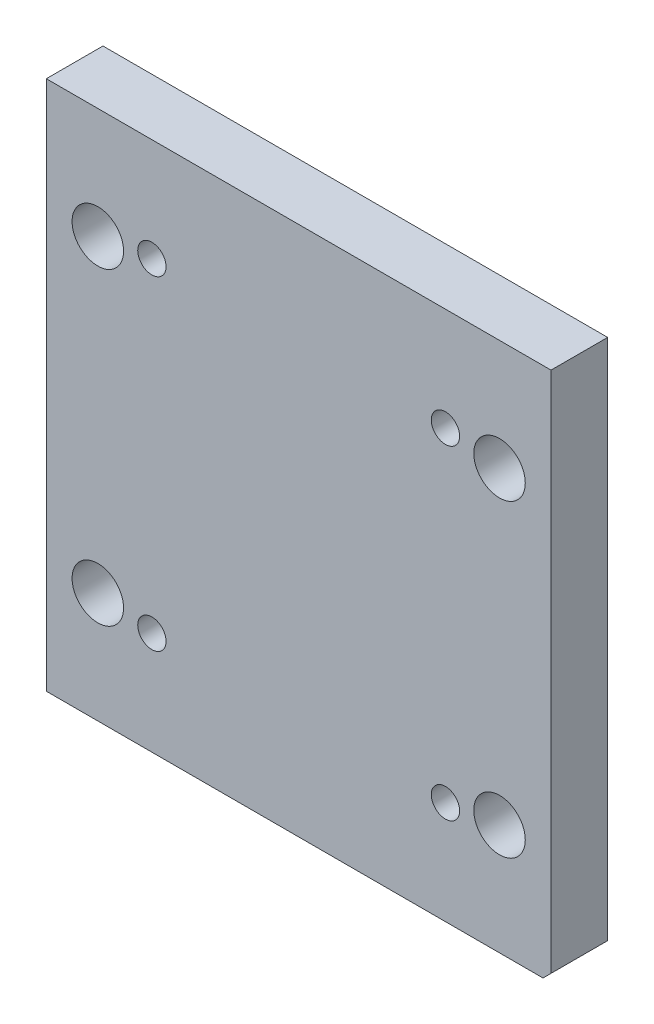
ISO-10303-21;
HEADER;
FILE_DESCRIPTION(('STEP AP214'),'2;1');
FILE_NAME('part.step','',(''),(''),'','','');
FILE_SCHEMA(('AUTOMOTIVE_DESIGN { 1 0 10303 214 1 1 1 1 }'));
ENDSEC;
DATA;
#1=APPLICATION_CONTEXT('core data for automotive mechanical design processes');
#2=APPLICATION_PROTOCOL_DEFINITION('international standard','automotive_design',2000,#1);
#3=PRODUCT_CONTEXT('',#1,'mechanical');
#4=PRODUCT('Part','Part','',(#3));
#5=PRODUCT_RELATED_PRODUCT_CATEGORY('part','',(#4));
#6=PRODUCT_DEFINITION_FORMATION('','',#4);
#7=PRODUCT_DEFINITION_CONTEXT('part definition',#1,'design');
#8=PRODUCT_DEFINITION('design','',#6,#7);
#9=PRODUCT_DEFINITION_SHAPE('','',#8);
#10=(LENGTH_UNIT() NAMED_UNIT(*) SI_UNIT(.MILLI.,.METRE.));
#11=(NAMED_UNIT(*) PLANE_ANGLE_UNIT() SI_UNIT($,.RADIAN.));
#12=(NAMED_UNIT(*) SI_UNIT($,.STERADIAN.) SOLID_ANGLE_UNIT());
#13=UNCERTAINTY_MEASURE_WITH_UNIT(LENGTH_MEASURE(1.E-05),#10,'distance_accuracy_value','');
#14=(GEOMETRIC_REPRESENTATION_CONTEXT(3) GLOBAL_UNCERTAINTY_ASSIGNED_CONTEXT((#13)) GLOBAL_UNIT_ASSIGNED_CONTEXT((#10,
#11,#12)) REPRESENTATION_CONTEXT('',''));
#15=CARTESIAN_POINT('',(0.,0.,0.));
#16=DIRECTION('',(0.,0.,1.));
#17=DIRECTION('',(1.,0.,0.));
#18=AXIS2_PLACEMENT_3D('',#15,#16,#17);
#19=CARTESIAN_POINT('',(-98.,-103.,-306.344861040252));
#20=DIRECTION('',(-1.,0.,0.));
#21=DIRECTION('',(0.,0.,1.));
#22=AXIS2_PLACEMENT_3D('',#19,#20,#21);
#23=PLANE('',#22);
#24=DIRECTION('',(0.,1.,0.));
#25=VECTOR('',#24,1.);
#26=CARTESIAN_POINT('',(-98.,-103.,-22.));
#27=LINE('',#26,#25);
#28=CARTESIAN_POINT('',(-98.,-103.,-22.));
#29=VERTEX_POINT('',#28);
#30=CARTESIAN_POINT('',(-98.,103.,-22.));
#31=VERTEX_POINT('',#30);
#32=EDGE_CURVE('E87',#29,#31,#27,.T.);
#33=ORIENTED_EDGE('',*,*,#32,.F.);
#34=DIRECTION('',(0.,0.,1.));
#35=VECTOR('',#34,1.);
#36=CARTESIAN_POINT('',(-98.,-103.,-306.344861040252));
#37=LINE('',#36,#35);
#38=CARTESIAN_POINT('',(-98.,-103.,0.));
#39=VERTEX_POINT('',#38);
#40=EDGE_CURVE('E81',#29,#39,#37,.T.);
#41=ORIENTED_EDGE('',*,*,#40,.T.);
#42=DIRECTION('',(0.,-1.,0.));
#43=VECTOR('',#42,1.);
#44=CARTESIAN_POINT('',(-98.,-103.,0.));
#45=LINE('',#44,#43);
#46=CARTESIAN_POINT('',(-98.,103.,0.));
#47=VERTEX_POINT('',#46);
#48=EDGE_CURVE('E85',#47,#39,#45,.T.);
#49=ORIENTED_EDGE('',*,*,#48,.F.);
#50=DIRECTION('',(0.,0.,1.));
#51=VECTOR('',#50,1.);
#52=CARTESIAN_POINT('',(-98.,103.,-306.344861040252));
#53=LINE('',#52,#51);
#54=EDGE_CURVE('E112',#31,#47,#53,.T.);
#55=ORIENTED_EDGE('',*,*,#54,.F.);
#56=EDGE_LOOP('',(#33,#41,#49,#55));
#57=FACE_BOUND('',#56,.T.);
#58=ADVANCED_FACE('F34',(#57),#23,.T.);
#59=CARTESIAN_POINT('',(-98.,103.,-306.344861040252));
#60=DIRECTION('',(0.,1.,0.));
#61=DIRECTION('',(-1.,0.,0.));
#62=AXIS2_PLACEMENT_3D('',#59,#60,#61);
#63=PLANE('',#62);
#64=DIRECTION('',(1.,0.,0.));
#65=VECTOR('',#64,1.);
#66=CARTESIAN_POINT('',(-98.,103.,-22.));
#67=LINE('',#66,#65);
#68=CARTESIAN_POINT('',(98.,103.,-22.));
#69=VERTEX_POINT('',#68);
#70=EDGE_CURVE('E121',#31,#69,#67,.T.);
#71=ORIENTED_EDGE('',*,*,#70,.F.);
#72=ORIENTED_EDGE('',*,*,#54,.T.);
#73=DIRECTION('',(-1.,0.,0.));
#74=VECTOR('',#73,1.);
#75=CARTESIAN_POINT('',(-98.,103.,0.));
#76=LINE('',#75,#74);
#77=CARTESIAN_POINT('',(98.,103.,0.));
#78=VERTEX_POINT('',#77);
#79=EDGE_CURVE('E91',#78,#47,#76,.T.);
#80=ORIENTED_EDGE('',*,*,#79,.F.);
#81=DIRECTION('',(0.,0.,1.));
#82=VECTOR('',#81,1.);
#83=CARTESIAN_POINT('',(98.,103.,-306.344861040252));
#84=LINE('',#83,#82);
#85=EDGE_CURVE('E90',#69,#78,#84,.T.);
#86=ORIENTED_EDGE('',*,*,#85,.F.);
#87=EDGE_LOOP('',(#71,#72,#80,#86));
#88=FACE_BOUND('',#87,.T.);
#89=ADVANCED_FACE('F214',(#88),#63,.T.);
#90=CARTESIAN_POINT('',(98.,-103.,-306.344861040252));
#91=DIRECTION('',(1.,0.,0.));
#92=DIRECTION('',(0.,1.,0.));
#93=AXIS2_PLACEMENT_3D('',#90,#91,#92);
#94=PLANE('',#93);
#95=DIRECTION('',(0.,1.,0.));
#96=VECTOR('',#95,1.);
#97=CARTESIAN_POINT('',(98.,-103.,0.));
#98=LINE('',#97,#96);
#99=CARTESIAN_POINT('',(98.,-99.88,0.));
#100=VERTEX_POINT('',#99);
#101=EDGE_CURVE('E98',#100,#78,#98,.T.);
#102=ORIENTED_EDGE('',*,*,#101,.F.);
#103=DIRECTION('',(0.,0.,-1.));
#104=VECTOR('',#103,1.);
#105=CARTESIAN_POINT('',(98.,-99.88,-306.344861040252));
#106=LINE('',#105,#104);
#107=CARTESIAN_POINT('',(98.,-99.88,-22.));
#108=VERTEX_POINT('',#107);
#109=EDGE_CURVE('E42',#100,#108,#106,.T.);
#110=ORIENTED_EDGE('',*,*,#109,.T.);
#111=DIRECTION('',(0.,-1.,0.));
#112=VECTOR('',#111,1.);
#113=CARTESIAN_POINT('',(98.,-103.,-22.));
#114=LINE('',#113,#112);
#115=EDGE_CURVE('E114',#69,#108,#114,.T.);
#116=ORIENTED_EDGE('',*,*,#115,.F.);
#117=ORIENTED_EDGE('',*,*,#85,.T.);
#118=EDGE_LOOP('',(#102,#110,#116,#117));
#119=FACE_BOUND('',#118,.T.);
#120=ADVANCED_FACE('F218',(#119),#94,.T.);
#121=CARTESIAN_POINT('',(-98.,-103.,-306.344861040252));
#122=DIRECTION('',(0.,-1.,0.));
#123=DIRECTION('',(1.,0.,0.));
#124=AXIS2_PLACEMENT_3D('',#121,#122,#123);
#125=PLANE('',#124);
#126=DIRECTION('',(-1.,0.,0.));
#127=VECTOR('',#126,1.);
#128=CARTESIAN_POINT('',(-98.,-103.,-22.));
#129=LINE('',#128,#127);
#130=CARTESIAN_POINT('',(94.88,-103.,-22.));
#131=VERTEX_POINT('',#130);
#132=EDGE_CURVE('E117',#131,#29,#129,.T.);
#133=ORIENTED_EDGE('',*,*,#132,.F.);
#134=DIRECTION('',(0.,0.,1.));
#135=VECTOR('',#134,1.);
#136=CARTESIAN_POINT('',(94.88,-103.,-306.344861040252));
#137=LINE('',#136,#135);
#138=CARTESIAN_POINT('',(94.88,-103.,0.));
#139=VERTEX_POINT('',#138);
#140=EDGE_CURVE('E97',#131,#139,#137,.T.);
#141=ORIENTED_EDGE('',*,*,#140,.T.);
#142=DIRECTION('',(1.,0.,0.));
#143=VECTOR('',#142,1.);
#144=CARTESIAN_POINT('',(-98.,-103.,0.));
#145=LINE('',#144,#143);
#146=EDGE_CURVE('E94',#39,#139,#145,.T.);
#147=ORIENTED_EDGE('',*,*,#146,.F.);
#148=ORIENTED_EDGE('',*,*,#40,.F.);
#149=EDGE_LOOP('',(#133,#141,#147,#148));
#150=FACE_BOUND('',#149,.T.);
#151=ADVANCED_FACE('F95',(#150),#125,.T.);
#152=CARTESIAN_POINT('',(0.,0.,0.));
#153=DIRECTION('',(0.,0.,-1.));
#154=DIRECTION('',(-1.,0.,0.));
#155=AXIS2_PLACEMENT_3D('',#152,#153,#154);
#156=PLANE('',#155);
#157=CARTESIAN_POINT('',(57.,-63.,0.));
#158=DIRECTION('',(0.,0.,-1.));
#159=DIRECTION('',(-1.,0.,0.));
#160=AXIS2_PLACEMENT_3D('',#157,#158,#159);
#161=CIRCLE('',#160,5.50000000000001);
#162=CARTESIAN_POINT('',(51.5,-63.,0.));
#163=VERTEX_POINT('',#162);
#164=EDGE_CURVE('E181',#163,#163,#161,.T.);
#165=ORIENTED_EDGE('',*,*,#164,.T.);
#166=EDGE_LOOP('',(#165));
#167=FACE_BOUND('',#166,.T.);
#168=CARTESIAN_POINT('',(-57.,-63.,0.));
#169=DIRECTION('',(0.,0.,-1.));
#170=DIRECTION('',(-1.,0.,0.));
#171=AXIS2_PLACEMENT_3D('',#168,#169,#170);
#172=CIRCLE('',#171,5.5);
#173=CARTESIAN_POINT('',(-62.5,-63.,0.));
#174=VERTEX_POINT('',#173);
#175=EDGE_CURVE('E169',#174,#174,#172,.T.);
#176=ORIENTED_EDGE('',*,*,#175,.T.);
#177=EDGE_LOOP('',(#176));
#178=FACE_BOUND('',#177,.T.);
#179=CARTESIAN_POINT('',(-57.,63.,0.));
#180=DIRECTION('',(0.,0.,-1.));
#181=DIRECTION('',(-1.,0.,0.));
#182=AXIS2_PLACEMENT_3D('',#179,#180,#181);
#183=CIRCLE('',#182,5.5);
#184=CARTESIAN_POINT('',(-62.5,63.,0.));
#185=VERTEX_POINT('',#184);
#186=EDGE_CURVE('E157',#185,#185,#183,.T.);
#187=ORIENTED_EDGE('',*,*,#186,.T.);
#188=EDGE_LOOP('',(#187));
#189=FACE_BOUND('',#188,.T.);
#190=CARTESIAN_POINT('',(57.,63.,0.));
#191=DIRECTION('',(0.,0.,-1.));
#192=DIRECTION('',(-1.,0.,0.));
#193=AXIS2_PLACEMENT_3D('',#190,#191,#192);
#194=CIRCLE('',#193,5.5);
#195=CARTESIAN_POINT('',(51.5,63.,0.));
#196=VERTEX_POINT('',#195);
#197=EDGE_CURVE('E145',#196,#196,#194,.T.);
#198=ORIENTED_EDGE('',*,*,#197,.T.);
#199=EDGE_LOOP('',(#198));
#200=FACE_BOUND('',#199,.T.);
#201=CARTESIAN_POINT('',(78.,-60.,0.));
#202=DIRECTION('',(0.,0.,1.));
#203=DIRECTION('',(1.,0.,0.));
#204=AXIS2_PLACEMENT_3D('',#201,#202,#203);
#205=CIRCLE('',#204,9.99999999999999);
#206=CARTESIAN_POINT('',(88.,-60.,0.));
#207=VERTEX_POINT('',#206);
#208=EDGE_CURVE('E142',#207,#207,#205,.T.);
#209=ORIENTED_EDGE('',*,*,#208,.F.);
#210=EDGE_LOOP('',(#209));
#211=FACE_BOUND('',#210,.T.);
#212=CARTESIAN_POINT('',(-78.,-60.,0.));
#213=DIRECTION('',(0.,0.,1.));
#214=DIRECTION('',(1.,0.,0.));
#215=AXIS2_PLACEMENT_3D('',#212,#213,#214);
#216=CIRCLE('',#215,9.99999999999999);
#217=CARTESIAN_POINT('',(-68.,-60.,0.));
#218=VERTEX_POINT('',#217);
#219=EDGE_CURVE('E136',#218,#218,#216,.T.);
#220=ORIENTED_EDGE('',*,*,#219,.F.);
#221=EDGE_LOOP('',(#220));
#222=FACE_BOUND('',#221,.T.);
#223=CARTESIAN_POINT('',(-78.,60.,0.));
#224=DIRECTION('',(0.,0.,1.));
#225=DIRECTION('',(1.,0.,0.));
#226=AXIS2_PLACEMENT_3D('',#223,#224,#225);
#227=CIRCLE('',#226,9.99999999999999);
#228=CARTESIAN_POINT('',(-68.,60.,0.));
#229=VERTEX_POINT('',#228);
#230=EDGE_CURVE('E130',#229,#229,#227,.T.);
#231=ORIENTED_EDGE('',*,*,#230,.F.);
#232=EDGE_LOOP('',(#231));
#233=FACE_BOUND('',#232,.T.);
#234=CARTESIAN_POINT('',(78.,60.,0.));
#235=DIRECTION('',(0.,0.,1.));
#236=DIRECTION('',(1.,0.,0.));
#237=AXIS2_PLACEMENT_3D('',#234,#235,#236);
#238=CIRCLE('',#237,9.99999999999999);
#239=CARTESIAN_POINT('',(88.,60.,0.));
#240=VERTEX_POINT('',#239);
#241=EDGE_CURVE('E105',#240,#240,#238,.T.);
#242=ORIENTED_EDGE('',*,*,#241,.F.);
#243=EDGE_LOOP('',(#242));
#244=FACE_BOUND('',#243,.T.);
#245=ORIENTED_EDGE('',*,*,#146,.T.);
#246=DIRECTION('',(-0.707106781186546,-0.707106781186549,0.));
#247=VECTOR('',#246,1.);
#248=CARTESIAN_POINT('',(94.88,-103.,0.));
#249=LINE('',#248,#247);
#250=EDGE_CURVE('E56',#139,#100,#249,.F.);
#251=ORIENTED_EDGE('',*,*,#250,.T.);
#252=ORIENTED_EDGE('',*,*,#101,.T.);
#253=ORIENTED_EDGE('',*,*,#79,.T.);
#254=ORIENTED_EDGE('',*,*,#48,.T.);
#255=EDGE_LOOP('',(#245,#251,#252,#253,#254));
#256=FACE_BOUND('',#255,.T.);
#257=ADVANCED_FACE('F100',(#167,#178,#189,#200,#211,#222,#233,#244,#256),#156,.F.);
#258=CARTESIAN_POINT('',(0.,0.,-22.));
#259=DIRECTION('',(0.,0.,1.));
#260=DIRECTION('',(1.,0.,0.));
#261=AXIS2_PLACEMENT_3D('',#258,#259,#260);
#262=PLANE('',#261);
#263=CARTESIAN_POINT('',(0.,0.,-22.));
#264=DIRECTION('',(0.,0.,1.));
#265=DIRECTION('',(1.,0.,0.));
#266=AXIS2_PLACEMENT_3D('',#263,#264,#265);
#267=CIRCLE('',#266,45.);
#268=CARTESIAN_POINT('',(45.,0.,-22.));
#269=VERTEX_POINT('',#268);
#270=EDGE_CURVE('E194',#269,#269,#267,.T.);
#271=ORIENTED_EDGE('',*,*,#270,.T.);
#272=EDGE_LOOP('',(#271));
#273=FACE_BOUND('',#272,.T.);
#274=CARTESIAN_POINT('',(57.,-63.,-22.));
#275=DIRECTION('',(0.,0.,-1.));
#276=DIRECTION('',(-1.,0.,0.));
#277=AXIS2_PLACEMENT_3D('',#274,#275,#276);
#278=CIRCLE('',#277,9.00000000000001);
#279=CARTESIAN_POINT('',(48.,-63.,-22.));
#280=VERTEX_POINT('',#279);
#281=EDGE_CURVE('E190',#280,#280,#278,.T.);
#282=ORIENTED_EDGE('',*,*,#281,.F.);
#283=EDGE_LOOP('',(#282));
#284=FACE_BOUND('',#283,.T.);
#285=CARTESIAN_POINT('',(-57.,-63.,-22.));
#286=DIRECTION('',(0.,0.,-1.));
#287=DIRECTION('',(-1.,0.,0.));
#288=AXIS2_PLACEMENT_3D('',#285,#286,#287);
#289=CIRCLE('',#288,9.);
#290=CARTESIAN_POINT('',(-66.,-63.,-22.));
#291=VERTEX_POINT('',#290);
#292=EDGE_CURVE('E178',#291,#291,#289,.T.);
#293=ORIENTED_EDGE('',*,*,#292,.F.);
#294=EDGE_LOOP('',(#293));
#295=FACE_BOUND('',#294,.T.);
#296=CARTESIAN_POINT('',(-57.,63.,-22.));
#297=DIRECTION('',(0.,0.,-1.));
#298=DIRECTION('',(-1.,0.,0.));
#299=AXIS2_PLACEMENT_3D('',#296,#297,#298);
#300=CIRCLE('',#299,9.);
#301=CARTESIAN_POINT('',(-66.,63.,-22.));
#302=VERTEX_POINT('',#301);
#303=EDGE_CURVE('E166',#302,#302,#300,.T.);
#304=ORIENTED_EDGE('',*,*,#303,.F.);
#305=EDGE_LOOP('',(#304));
#306=FACE_BOUND('',#305,.T.);
#307=CARTESIAN_POINT('',(57.,63.,-22.));
#308=DIRECTION('',(0.,0.,-1.));
#309=DIRECTION('',(-1.,0.,0.));
#310=AXIS2_PLACEMENT_3D('',#307,#308,#309);
#311=CIRCLE('',#310,9.00000000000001);
#312=CARTESIAN_POINT('',(48.,63.,-22.));
#313=VERTEX_POINT('',#312);
#314=EDGE_CURVE('E154',#313,#313,#311,.T.);
#315=ORIENTED_EDGE('',*,*,#314,.F.);
#316=EDGE_LOOP('',(#315));
#317=FACE_BOUND('',#316,.T.);
#318=CARTESIAN_POINT('',(78.,-60.,-22.));
#319=DIRECTION('',(0.,0.,1.));
#320=DIRECTION('',(1.,0.,0.));
#321=AXIS2_PLACEMENT_3D('',#318,#319,#320);
#322=CIRCLE('',#321,9.99999999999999);
#323=CARTESIAN_POINT('',(88.,-60.,-22.));
#324=VERTEX_POINT('',#323);
#325=EDGE_CURVE('E139',#324,#324,#322,.T.);
#326=ORIENTED_EDGE('',*,*,#325,.T.);
#327=EDGE_LOOP('',(#326));
#328=FACE_BOUND('',#327,.T.);
#329=CARTESIAN_POINT('',(-78.,-60.,-22.));
#330=DIRECTION('',(0.,0.,1.));
#331=DIRECTION('',(1.,0.,0.));
#332=AXIS2_PLACEMENT_3D('',#329,#330,#331);
#333=CIRCLE('',#332,9.99999999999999);
#334=CARTESIAN_POINT('',(-68.,-60.,-22.));
#335=VERTEX_POINT('',#334);
#336=EDGE_CURVE('E133',#335,#335,#333,.T.);
#337=ORIENTED_EDGE('',*,*,#336,.T.);
#338=EDGE_LOOP('',(#337));
#339=FACE_BOUND('',#338,.T.);
#340=CARTESIAN_POINT('',(-78.,60.,-22.));
#341=DIRECTION('',(0.,0.,1.));
#342=DIRECTION('',(1.,0.,0.));
#343=AXIS2_PLACEMENT_3D('',#340,#341,#342);
#344=CIRCLE('',#343,9.99999999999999);
#345=CARTESIAN_POINT('',(-68.,60.,-22.));
#346=VERTEX_POINT('',#345);
#347=EDGE_CURVE('E127',#346,#346,#344,.T.);
#348=ORIENTED_EDGE('',*,*,#347,.T.);
#349=EDGE_LOOP('',(#348));
#350=FACE_BOUND('',#349,.T.);
#351=CARTESIAN_POINT('',(78.,60.,-22.));
#352=DIRECTION('',(0.,0.,1.));
#353=DIRECTION('',(1.,0.,0.));
#354=AXIS2_PLACEMENT_3D('',#351,#352,#353);
#355=CIRCLE('',#354,9.99999999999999);
#356=CARTESIAN_POINT('',(88.,60.,-22.));
#357=VERTEX_POINT('',#356);
#358=EDGE_CURVE('E102',#357,#357,#355,.T.);
#359=ORIENTED_EDGE('',*,*,#358,.T.);
#360=EDGE_LOOP('',(#359));
#361=FACE_BOUND('',#360,.T.);
#362=ORIENTED_EDGE('',*,*,#115,.T.);
#363=DIRECTION('',(0.707106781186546,0.707106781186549,0.));
#364=VECTOR('',#363,1.);
#365=CARTESIAN_POINT('',(94.88,-103.,-22.));
#366=LINE('',#365,#364);
#367=EDGE_CURVE('E11',#108,#131,#366,.F.);
#368=ORIENTED_EDGE('',*,*,#367,.T.);
#369=ORIENTED_EDGE('',*,*,#132,.T.);
#370=ORIENTED_EDGE('',*,*,#32,.T.);
#371=ORIENTED_EDGE('',*,*,#70,.T.);
#372=EDGE_LOOP('',(#362,#368,#369,#370,#371));
#373=FACE_BOUND('',#372,.T.);
#374=ADVANCED_FACE('F228',(#273,#284,#295,#306,#317,#328,#339,#350,#361,#373),#262,.F.);
#375=CARTESIAN_POINT('',(78.,60.,0.));
#376=DIRECTION('',(0.,0.,1.));
#377=DIRECTION('',(1.,0.,0.));
#378=AXIS2_PLACEMENT_3D('',#375,#376,#377);
#379=CYLINDRICAL_SURFACE('',#378,9.99999999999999);
#380=ORIENTED_EDGE('',*,*,#358,.F.);
#381=EDGE_LOOP('',(#380));
#382=FACE_BOUND('',#381,.T.);
#383=ORIENTED_EDGE('',*,*,#241,.T.);
#384=EDGE_LOOP('',(#383));
#385=FACE_BOUND('',#384,.T.);
#386=ADVANCED_FACE('F232',(#382,#385),#379,.F.);
#387=CARTESIAN_POINT('',(-78.,60.,0.));
#388=DIRECTION('',(0.,0.,1.));
#389=DIRECTION('',(1.,0.,0.));
#390=AXIS2_PLACEMENT_3D('',#387,#388,#389);
#391=CYLINDRICAL_SURFACE('',#390,9.99999999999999);
#392=ORIENTED_EDGE('',*,*,#347,.F.);
#393=EDGE_LOOP('',(#392));
#394=FACE_BOUND('',#393,.T.);
#395=ORIENTED_EDGE('',*,*,#230,.T.);
#396=EDGE_LOOP('',(#395));
#397=FACE_BOUND('',#396,.T.);
#398=ADVANCED_FACE('F236',(#394,#397),#391,.F.);
#399=CARTESIAN_POINT('',(-78.,-60.,0.));
#400=DIRECTION('',(0.,0.,1.));
#401=DIRECTION('',(1.,0.,0.));
#402=AXIS2_PLACEMENT_3D('',#399,#400,#401);
#403=CYLINDRICAL_SURFACE('',#402,9.99999999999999);
#404=ORIENTED_EDGE('',*,*,#336,.F.);
#405=EDGE_LOOP('',(#404));
#406=FACE_BOUND('',#405,.T.);
#407=ORIENTED_EDGE('',*,*,#219,.T.);
#408=EDGE_LOOP('',(#407));
#409=FACE_BOUND('',#408,.T.);
#410=ADVANCED_FACE('F240',(#406,#409),#403,.F.);
#411=CARTESIAN_POINT('',(78.,-60.,0.));
#412=DIRECTION('',(0.,0.,1.));
#413=DIRECTION('',(1.,0.,0.));
#414=AXIS2_PLACEMENT_3D('',#411,#412,#413);
#415=CYLINDRICAL_SURFACE('',#414,9.99999999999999);
#416=ORIENTED_EDGE('',*,*,#325,.F.);
#417=EDGE_LOOP('',(#416));
#418=FACE_BOUND('',#417,.T.);
#419=ORIENTED_EDGE('',*,*,#208,.T.);
#420=EDGE_LOOP('',(#419));
#421=FACE_BOUND('',#420,.T.);
#422=ADVANCED_FACE('F244',(#418,#421),#415,.F.);
#423=CARTESIAN_POINT('',(57.,63.,-22.));
#424=DIRECTION('',(0.,0.,-1.));
#425=DIRECTION('',(-1.,0.,0.));
#426=AXIS2_PLACEMENT_3D('',#423,#424,#425);
#427=CYLINDRICAL_SURFACE('',#426,5.5);
#428=ORIENTED_EDGE('',*,*,#197,.F.);
#429=EDGE_LOOP('',(#428));
#430=FACE_BOUND('',#429,.T.);
#431=CARTESIAN_POINT('',(57.,63.,-9.));
#432=DIRECTION('',(0.,0.,-1.));
#433=DIRECTION('',(-1.,0.,0.));
#434=AXIS2_PLACEMENT_3D('',#431,#432,#433);
#435=CIRCLE('',#434,5.5);
#436=CARTESIAN_POINT('',(51.5,63.,-9.));
#437=VERTEX_POINT('',#436);
#438=EDGE_CURVE('E148',#437,#437,#435,.T.);
#439=ORIENTED_EDGE('',*,*,#438,.T.);
#440=EDGE_LOOP('',(#439));
#441=FACE_BOUND('',#440,.T.);
#442=ADVANCED_FACE('F248',(#430,#441),#427,.F.);
#443=CARTESIAN_POINT('',(62.5,63.,-9.));
#444=DIRECTION('',(0.,0.,1.));
#445=DIRECTION('',(1.,0.,0.));
#446=AXIS2_PLACEMENT_3D('',#443,#444,#445);
#447=PLANE('',#446);
#448=ORIENTED_EDGE('',*,*,#438,.F.);
#449=EDGE_LOOP('',(#448));
#450=FACE_BOUND('',#449,.T.);
#451=CARTESIAN_POINT('',(57.,63.,-9.));
#452=DIRECTION('',(0.,0.,-1.));
#453=DIRECTION('',(-1.,0.,0.));
#454=AXIS2_PLACEMENT_3D('',#451,#452,#453);
#455=CIRCLE('',#454,9.00000000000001);
#456=CARTESIAN_POINT('',(48.,63.,-9.));
#457=VERTEX_POINT('',#456);
#458=EDGE_CURVE('E151',#457,#457,#455,.T.);
#459=ORIENTED_EDGE('',*,*,#458,.T.);
#460=EDGE_LOOP('',(#459));
#461=FACE_BOUND('',#460,.T.);
#462=ADVANCED_FACE('F252',(#450,#461),#447,.F.);
#463=CARTESIAN_POINT('',(57.,63.,-22.));
#464=DIRECTION('',(0.,0.,-1.));
#465=DIRECTION('',(-1.,0.,0.));
#466=AXIS2_PLACEMENT_3D('',#463,#464,#465);
#467=CYLINDRICAL_SURFACE('',#466,9.00000000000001);
#468=ORIENTED_EDGE('',*,*,#458,.F.);
#469=EDGE_LOOP('',(#468));
#470=FACE_BOUND('',#469,.T.);
#471=ORIENTED_EDGE('',*,*,#314,.T.);
#472=EDGE_LOOP('',(#471));
#473=FACE_BOUND('',#472,.T.);
#474=ADVANCED_FACE('F256',(#470,#473),#467,.F.);
#475=CARTESIAN_POINT('',(-57.,63.,-22.));
#476=DIRECTION('',(0.,0.,-1.));
#477=DIRECTION('',(-1.,0.,0.));
#478=AXIS2_PLACEMENT_3D('',#475,#476,#477);
#479=CYLINDRICAL_SURFACE('',#478,5.5);
#480=ORIENTED_EDGE('',*,*,#186,.F.);
#481=EDGE_LOOP('',(#480));
#482=FACE_BOUND('',#481,.T.);
#483=CARTESIAN_POINT('',(-57.,63.,-9.));
#484=DIRECTION('',(0.,0.,-1.));
#485=DIRECTION('',(-1.,0.,0.));
#486=AXIS2_PLACEMENT_3D('',#483,#484,#485);
#487=CIRCLE('',#486,5.5);
#488=CARTESIAN_POINT('',(-62.5,63.,-9.));
#489=VERTEX_POINT('',#488);
#490=EDGE_CURVE('E160',#489,#489,#487,.T.);
#491=ORIENTED_EDGE('',*,*,#490,.T.);
#492=EDGE_LOOP('',(#491));
#493=FACE_BOUND('',#492,.T.);
#494=ADVANCED_FACE('F260',(#482,#493),#479,.F.);
#495=CARTESIAN_POINT('',(-51.5,63.,-9.));
#496=DIRECTION('',(0.,0.,1.));
#497=DIRECTION('',(1.,0.,0.));
#498=AXIS2_PLACEMENT_3D('',#495,#496,#497);
#499=PLANE('',#498);
#500=ORIENTED_EDGE('',*,*,#490,.F.);
#501=EDGE_LOOP('',(#500));
#502=FACE_BOUND('',#501,.T.);
#503=CARTESIAN_POINT('',(-57.,63.,-9.));
#504=DIRECTION('',(0.,0.,-1.));
#505=DIRECTION('',(-1.,0.,0.));
#506=AXIS2_PLACEMENT_3D('',#503,#504,#505);
#507=CIRCLE('',#506,9.);
#508=CARTESIAN_POINT('',(-66.,63.,-9.));
#509=VERTEX_POINT('',#508);
#510=EDGE_CURVE('E163',#509,#509,#507,.T.);
#511=ORIENTED_EDGE('',*,*,#510,.T.);
#512=EDGE_LOOP('',(#511));
#513=FACE_BOUND('',#512,.T.);
#514=ADVANCED_FACE('F264',(#502,#513),#499,.F.);
#515=CARTESIAN_POINT('',(-57.,63.,-22.));
#516=DIRECTION('',(0.,0.,-1.));
#517=DIRECTION('',(-1.,0.,0.));
#518=AXIS2_PLACEMENT_3D('',#515,#516,#517);
#519=CYLINDRICAL_SURFACE('',#518,9.);
#520=ORIENTED_EDGE('',*,*,#510,.F.);
#521=EDGE_LOOP('',(#520));
#522=FACE_BOUND('',#521,.T.);
#523=ORIENTED_EDGE('',*,*,#303,.T.);
#524=EDGE_LOOP('',(#523));
#525=FACE_BOUND('',#524,.T.);
#526=ADVANCED_FACE('F268',(#522,#525),#519,.F.);
#527=CARTESIAN_POINT('',(-57.,-63.,-22.));
#528=DIRECTION('',(0.,0.,-1.));
#529=DIRECTION('',(-1.,0.,0.));
#530=AXIS2_PLACEMENT_3D('',#527,#528,#529);
#531=CYLINDRICAL_SURFACE('',#530,5.5);
#532=ORIENTED_EDGE('',*,*,#175,.F.);
#533=EDGE_LOOP('',(#532));
#534=FACE_BOUND('',#533,.T.);
#535=CARTESIAN_POINT('',(-57.,-63.,-9.));
#536=DIRECTION('',(0.,0.,-1.));
#537=DIRECTION('',(-1.,0.,0.));
#538=AXIS2_PLACEMENT_3D('',#535,#536,#537);
#539=CIRCLE('',#538,5.5);
#540=CARTESIAN_POINT('',(-62.5,-63.,-9.));
#541=VERTEX_POINT('',#540);
#542=EDGE_CURVE('E172',#541,#541,#539,.T.);
#543=ORIENTED_EDGE('',*,*,#542,.T.);
#544=EDGE_LOOP('',(#543));
#545=FACE_BOUND('',#544,.T.);
#546=ADVANCED_FACE('F272',(#534,#545),#531,.F.);
#547=CARTESIAN_POINT('',(-51.5,-63.,-9.));
#548=DIRECTION('',(0.,0.,1.));
#549=DIRECTION('',(1.,0.,0.));
#550=AXIS2_PLACEMENT_3D('',#547,#548,#549);
#551=PLANE('',#550);
#552=ORIENTED_EDGE('',*,*,#542,.F.);
#553=EDGE_LOOP('',(#552));
#554=FACE_BOUND('',#553,.T.);
#555=CARTESIAN_POINT('',(-57.,-63.,-9.));
#556=DIRECTION('',(0.,0.,-1.));
#557=DIRECTION('',(-1.,0.,0.));
#558=AXIS2_PLACEMENT_3D('',#555,#556,#557);
#559=CIRCLE('',#558,9.);
#560=CARTESIAN_POINT('',(-66.,-63.,-9.));
#561=VERTEX_POINT('',#560);
#562=EDGE_CURVE('E175',#561,#561,#559,.T.);
#563=ORIENTED_EDGE('',*,*,#562,.T.);
#564=EDGE_LOOP('',(#563));
#565=FACE_BOUND('',#564,.T.);
#566=ADVANCED_FACE('F276',(#554,#565),#551,.F.);
#567=CARTESIAN_POINT('',(-57.,-63.,-22.));
#568=DIRECTION('',(0.,0.,-1.));
#569=DIRECTION('',(-1.,0.,0.));
#570=AXIS2_PLACEMENT_3D('',#567,#568,#569);
#571=CYLINDRICAL_SURFACE('',#570,9.);
#572=ORIENTED_EDGE('',*,*,#562,.F.);
#573=EDGE_LOOP('',(#572));
#574=FACE_BOUND('',#573,.T.);
#575=ORIENTED_EDGE('',*,*,#292,.T.);
#576=EDGE_LOOP('',(#575));
#577=FACE_BOUND('',#576,.T.);
#578=ADVANCED_FACE('F280',(#574,#577),#571,.F.);
#579=CARTESIAN_POINT('',(57.,-63.,-22.));
#580=DIRECTION('',(0.,0.,-1.));
#581=DIRECTION('',(-1.,0.,0.));
#582=AXIS2_PLACEMENT_3D('',#579,#580,#581);
#583=CYLINDRICAL_SURFACE('',#582,5.50000000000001);
#584=ORIENTED_EDGE('',*,*,#164,.F.);
#585=EDGE_LOOP('',(#584));
#586=FACE_BOUND('',#585,.T.);
#587=CARTESIAN_POINT('',(57.,-63.,-9.));
#588=DIRECTION('',(0.,0.,-1.));
#589=DIRECTION('',(-1.,0.,0.));
#590=AXIS2_PLACEMENT_3D('',#587,#588,#589);
#591=CIRCLE('',#590,5.50000000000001);
#592=CARTESIAN_POINT('',(51.5,-63.,-9.));
#593=VERTEX_POINT('',#592);
#594=EDGE_CURVE('E184',#593,#593,#591,.T.);
#595=ORIENTED_EDGE('',*,*,#594,.T.);
#596=EDGE_LOOP('',(#595));
#597=FACE_BOUND('',#596,.T.);
#598=ADVANCED_FACE('F284',(#586,#597),#583,.F.);
#599=CARTESIAN_POINT('',(62.5,-63.,-9.));
#600=DIRECTION('',(0.,0.,1.));
#601=DIRECTION('',(1.,0.,0.));
#602=AXIS2_PLACEMENT_3D('',#599,#600,#601);
#603=PLANE('',#602);
#604=ORIENTED_EDGE('',*,*,#594,.F.);
#605=EDGE_LOOP('',(#604));
#606=FACE_BOUND('',#605,.T.);
#607=CARTESIAN_POINT('',(57.,-63.,-9.));
#608=DIRECTION('',(0.,0.,-1.));
#609=DIRECTION('',(-1.,0.,0.));
#610=AXIS2_PLACEMENT_3D('',#607,#608,#609);
#611=CIRCLE('',#610,8.99999999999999);
#612=CARTESIAN_POINT('',(48.,-63.,-9.));
#613=VERTEX_POINT('',#612);
#614=EDGE_CURVE('E187',#613,#613,#611,.T.);
#615=ORIENTED_EDGE('',*,*,#614,.T.);
#616=EDGE_LOOP('',(#615));
#617=FACE_BOUND('',#616,.T.);
#618=ADVANCED_FACE('F288',(#606,#617),#603,.F.);
#619=CARTESIAN_POINT('',(57.,-63.,-22.));
#620=DIRECTION('',(0.,0.,-1.));
#621=DIRECTION('',(-1.,0.,0.));
#622=AXIS2_PLACEMENT_3D('',#619,#620,#621);
#623=CYLINDRICAL_SURFACE('',#622,9.);
#624=ORIENTED_EDGE('',*,*,#614,.F.);
#625=EDGE_LOOP('',(#624));
#626=FACE_BOUND('',#625,.T.);
#627=ORIENTED_EDGE('',*,*,#281,.T.);
#628=EDGE_LOOP('',(#627));
#629=FACE_BOUND('',#628,.T.);
#630=ADVANCED_FACE('F211',(#626,#629),#623,.F.);
#631=CARTESIAN_POINT('',(0.,0.,-17.95));
#632=DIRECTION('',(0.,0.,-1.));
#633=DIRECTION('',(-1.,0.,0.));
#634=AXIS2_PLACEMENT_3D('',#631,#632,#633);
#635=CYLINDRICAL_SURFACE('',#634,45.);
#636=CARTESIAN_POINT('',(0.,0.,-17.95));
#637=DIRECTION('',(0.,0.,1.));
#638=DIRECTION('',(1.,0.,0.));
#639=AXIS2_PLACEMENT_3D('',#636,#637,#638);
#640=CIRCLE('',#639,45.);
#641=CARTESIAN_POINT('',(45.,0.,-17.95));
#642=VERTEX_POINT('',#641);
#643=EDGE_CURVE('E193',#642,#642,#640,.T.);
#644=ORIENTED_EDGE('',*,*,#643,.T.);
#645=EDGE_LOOP('',(#644));
#646=FACE_BOUND('',#645,.T.);
#647=ORIENTED_EDGE('',*,*,#270,.F.);
#648=EDGE_LOOP('',(#647));
#649=FACE_BOUND('',#648,.T.);
#650=ADVANCED_FACE('F200',(#646,#649),#635,.F.);
#651=CARTESIAN_POINT('',(0.,0.,-17.95));
#652=DIRECTION('',(0.,0.,1.));
#653=DIRECTION('',(1.,0.,0.));
#654=AXIS2_PLACEMENT_3D('',#651,#652,#653);
#655=PLANE('',#654);
#656=ORIENTED_EDGE('',*,*,#643,.F.);
#657=EDGE_LOOP('',(#656));
#658=FACE_BOUND('',#657,.T.);
#659=ADVANCED_FACE('F203',(#658),#655,.F.);
#660=CARTESIAN_POINT('',(94.88,-103.,-306.344861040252));
#661=DIRECTION('',(-0.707106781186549,0.707106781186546,0.));
#662=DIRECTION('',(0.,0.,1.));
#663=AXIS2_PLACEMENT_3D('',#660,#661,#662);
#664=PLANE('',#663);
#665=ORIENTED_EDGE('',*,*,#367,.F.);
#666=ORIENTED_EDGE('',*,*,#109,.F.);
#667=ORIENTED_EDGE('',*,*,#250,.F.);
#668=ORIENTED_EDGE('',*,*,#140,.F.);
#669=EDGE_LOOP('',(#665,#666,#667,#668));
#670=FACE_BOUND('',#669,.T.);
#671=ADVANCED_FACE('F36',(#670),#664,.F.);
#672=CLOSED_SHELL('',(#58,#89,#120,#151,#257,#374,#386,#398,#410,#422,#442,#462,#474,#494,#514,
#526,#546,#566,#578,#598,#618,#630,#650,#659,#671));
#673=MANIFOLD_SOLID_BREP('B2',#672);
#674=ADVANCED_BREP_SHAPE_REPRESENTATION('',(#18,#673),#14);
#675=SHAPE_DEFINITION_REPRESENTATION(#9,#674);
ENDSEC;
END-ISO-10303-21;
